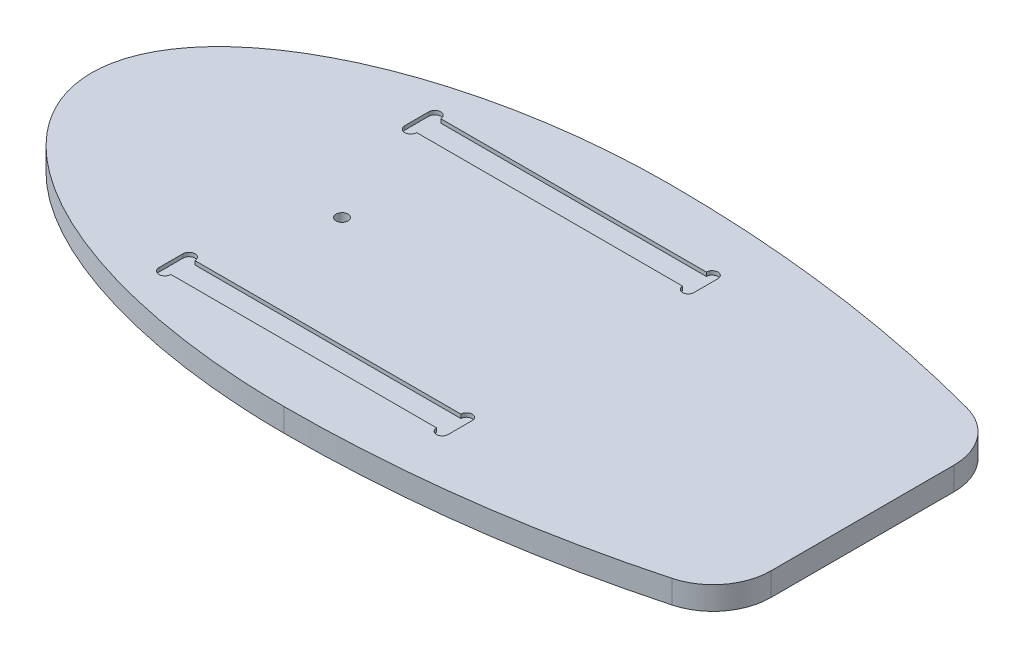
from build123d import *

# Parameters (mm, degrees)
BOSS_EXTRUDE1_DEPTH = 12
CUT_EXTRUDE1_DEPTH  = 2
SKETCH3_R           = 3.1
CUT_EXTRUDE2_DEPTH  = 224.928560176
FILLET1_R           = 30


with BuildPart() as part:
    # Sketch1 → Boss-Extrude1 (new body)
    with BuildSketch(Plane(origin=(0, 0, 0), x_dir=(1, 0, 0), z_dir=(0, 1, 0))):
        with BuildLine():
            Line((200, 70.136908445), (200, -70.136908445))
            ThreePointArc((200, -70.136908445), (101.108610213, -92.493072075), (0, -100))
            add(Edge.make_bspline(
                [(0, 100), (-200, 100), (-200, 0), (-200, -100), (0, -100)],
                knots=[4.71238898, 4.71238898, 4.71238898, 6.283185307, 6.283185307, 7.853981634, 7.853981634, 7.853981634], degree=2, weights=[1, 0.707106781, 1, 0.707106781, 1]))
            ThreePointArc((0, 100), (101.108610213, 92.493072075), (200, 70.136908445))
        make_face()
    extrude(amount=-BOSS_EXTRUDE1_DEPTH)

    # Sketch1_3 → Cut-Extrude1 (cut)
    with BuildSketch(Plane(origin=(0, 0, 0), x_dir=(1, 0, 0), z_dir=(0, 1, 0))):
        with BuildLine():
            Line((-88.8, 70), (49, 70))
            ThreePointArc((49, 70), (52, 73), (55, 70))
            Line((55, 70), (55, 57.5))
            ThreePointArc((55, 57.5), (52.088414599, 54.588414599), (49.176829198, 57.5))
            Line((49.176829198, 57.5), (-88.8, 57.5))
            ThreePointArc((-88.8, 57.5), (-91.9, 54.4), (-95, 57.5))
            Line((-95, 57.5), (-95, 70))
            ThreePointArc((-95, 70), (-91.9, 73.1), (-88.8, 70))
        make_face()
        with BuildLine():
            Line((55, -70), (55, -57.5))
            ThreePointArc((55, -57.5), (52.088414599, -54.588414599), (49.176829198, -57.5))
            Line((49.176829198, -57.5), (-88.8, -57.5))
            ThreePointArc((-88.8, -57.5), (-91.9, -54.4), (-95, -57.5))
            Line((-95, -57.5), (-95, -70))
            ThreePointArc((-95, -70), (-91.9, -73.1), (-88.8, -70))
            Line((-88.8, -70), (49, -70))
            ThreePointArc((49, -70), (52, -73), (55, -70))
        make_face()
    extrude(amount=-CUT_EXTRUDE1_DEPTH, mode=Mode.SUBTRACT)

    # Sketch3 → Cut-Extrude2 (cut, through all)
    with BuildSketch(Plane(origin=(0, 0, 0), x_dir=(1, 0, 0), z_dir=(0, 1, 0))):
        with Locations(Location((-70, 0, 0), (0, 0, 270))):
            Circle(SKETCH3_R)
    extrude(amount=-CUT_EXTRUDE2_DEPTH, mode=Mode.SUBTRACT)

    # Fillet1
    fillet1_edges = [part.edges().sort_by_distance(p)[0] for p in [
        (200, -6, -70.136908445),
        (200, -6, 70.136908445),
    ]]
    fillet(fillet1_edges, radius=FILLET1_R)


solid = part.part
